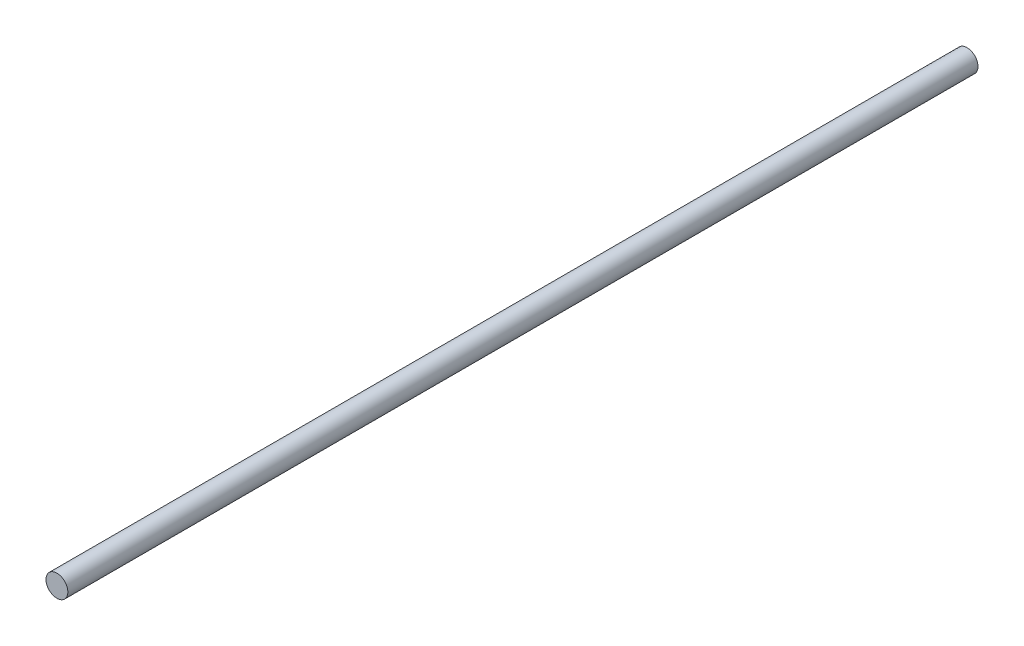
from build123d import *

# Parameters (mm, degrees)
SKETCH_1_R      = 6
EXTRUDE_1_DEPTH = 500


with BuildPart() as part:
    # Sketch 1 → Extrude 1 (new body)
    with BuildSketch(Plane.XY):
        with Locations((-1.294163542, 0)):
            Circle(SKETCH_1_R)
    extrude(amount=EXTRUDE_1_DEPTH)


solid = part.part
